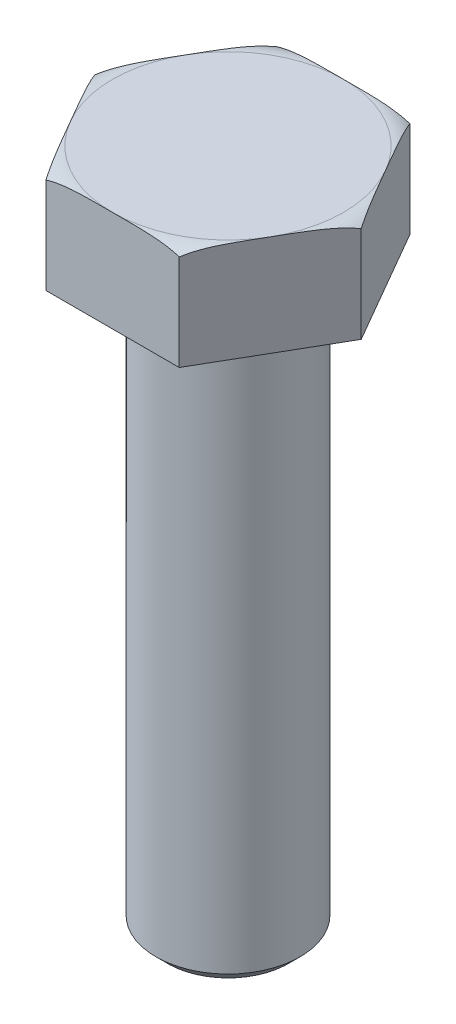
from build123d import *

# Parameters (mm, degrees)
EXTRUSION1_DEPTH = 3.5


with BuildPart() as part:
    # Esquisse4 → Extrusion1 (new body)
    with BuildSketch(Plane(origin=(0, 0, 0), x_dir=(1, 0, 0), z_dir=(0, 1, 0))):
        Polygon((4.618802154, 0), (2.309401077, 4), (-2.309401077, 4), (-4.618802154, 0), (-2.309401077, -4), (2.309401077, -4), align=None)
    extrude(amount=EXTRUSION1_DEPTH)

    # Esquisse2 → Enl_vement de mati_re-R_volution1 (revolve, cut)
    with BuildSketch(Plane(origin=(0, 6, 0), x_dir=(1, 0, 0), z_dir=(0, 0, -1))):
        with BuildLine():
            Line((4, 2.5), (4.618802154, 2.5))
            Line((4.618802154, 2.5), (4.618802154, 2.677629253))
            ThreePointArc((4.618802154, 2.677629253), (4.321896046, 2.545286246), (4, 2.5))
        make_face()
    revolve(axis=Axis((0, 0, 0), (0, 1, 0)), mode=Mode.SUBTRACT)


with BuildPart() as body_2:
    # Esquisse1 → R_volution1 (revolve)
    with BuildSketch(Plane.XY, mode=Mode.PRIVATE) as r_volution1_sk:
        with BuildLine():
            Line((0, 0), (2.75, 0))
            ThreePointArc((2.75, 0), (2.573223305, -0.073223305), (2.5, -0.25))
            Line((2.5, -0.25), (2.5, -19.6))
            Line((2.5, -19.6), (2.1, -20))
            Line((2.1, -20), (0, -20))
            Line((0, -20), (0, 0))
        make_face()
    revolve(r_volution1_sk.sketch.rotate(Axis((0, 0, 0), (0, -1, 0)), 180), axis=Axis((0, 0, 0), (0, -1, 0)))


solid = Compound([part.part, body_2.part])
